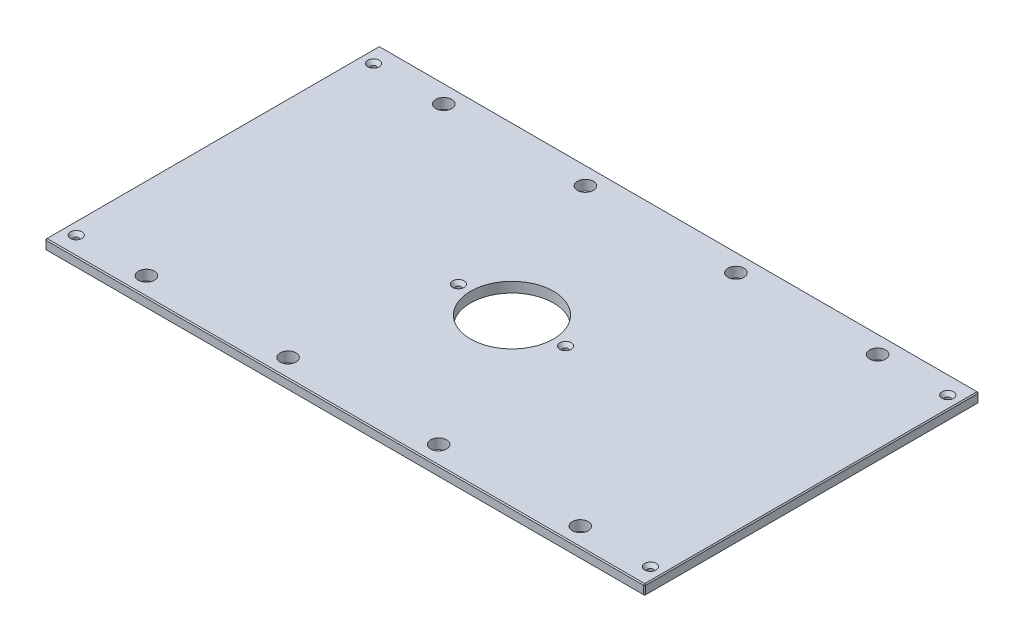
ISO-10303-21;
HEADER;
FILE_DESCRIPTION(('STEP AP214'),'2;1');
FILE_NAME('part.step','',(''),(''),'','','');
FILE_SCHEMA(('AUTOMOTIVE_DESIGN { 1 0 10303 214 1 1 1 1 }'));
ENDSEC;
DATA;
#1=APPLICATION_CONTEXT('core data for automotive mechanical design processes');
#2=APPLICATION_PROTOCOL_DEFINITION('international standard','automotive_design',2000,#1);
#3=PRODUCT_CONTEXT('',#1,'mechanical');
#4=PRODUCT('Part','Part','',(#3));
#5=PRODUCT_RELATED_PRODUCT_CATEGORY('part','',(#4));
#6=PRODUCT_DEFINITION_FORMATION('','',#4);
#7=PRODUCT_DEFINITION_CONTEXT('part definition',#1,'design');
#8=PRODUCT_DEFINITION('design','',#6,#7);
#9=PRODUCT_DEFINITION_SHAPE('','',#8);
#10=(LENGTH_UNIT() NAMED_UNIT(*) SI_UNIT(.MILLI.,.METRE.));
#11=(NAMED_UNIT(*) PLANE_ANGLE_UNIT() SI_UNIT($,.RADIAN.));
#12=(NAMED_UNIT(*) SI_UNIT($,.STERADIAN.) SOLID_ANGLE_UNIT());
#13=UNCERTAINTY_MEASURE_WITH_UNIT(LENGTH_MEASURE(1.E-05),#10,'distance_accuracy_value','');
#14=(GEOMETRIC_REPRESENTATION_CONTEXT(3) GLOBAL_UNCERTAINTY_ASSIGNED_CONTEXT((#13)) GLOBAL_UNIT_ASSIGNED_CONTEXT((#10,
#11,#12)) REPRESENTATION_CONTEXT('',''));
#15=CARTESIAN_POINT('',(0.,0.,0.));
#16=DIRECTION('',(0.,0.,1.));
#17=DIRECTION('',(1.,0.,0.));
#18=AXIS2_PLACEMENT_3D('',#15,#16,#17);
#19=CARTESIAN_POINT('',(-373.0625,12.7,-207.9625));
#20=DIRECTION('',(1.,0.,0.));
#21=DIRECTION('',(0.,0.,-1.));
#22=AXIS2_PLACEMENT_3D('',#19,#20,#21);
#23=PLANE('',#22);
#24=DIRECTION('',(0.,0.,-1.));
#25=VECTOR('',#24,1.);
#26=CARTESIAN_POINT('',(-373.0625,11.4299999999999,-207.9625));
#27=LINE('',#26,#25);
#28=CARTESIAN_POINT('',(-373.0625,11.4299999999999,206.6925));
#29=VERTEX_POINT('',#28);
#30=CARTESIAN_POINT('',(-373.0625,11.4299999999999,-206.6925));
#31=VERTEX_POINT('',#30);
#32=EDGE_CURVE('E135',#29,#31,#27,.T.);
#33=ORIENTED_EDGE('',*,*,#32,.T.);
#34=DIRECTION('',(0.,-1.,0.));
#35=VECTOR('',#34,1.);
#36=CARTESIAN_POINT('',(-373.0625,12.7,-206.6925));
#37=LINE('',#36,#35);
#38=CARTESIAN_POINT('',(-373.0625,1.2700000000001,-206.6925));
#39=VERTEX_POINT('',#38);
#40=EDGE_CURVE('E131',#31,#39,#37,.T.);
#41=ORIENTED_EDGE('',*,*,#40,.T.);
#42=DIRECTION('',(0.,0.,1.));
#43=VECTOR('',#42,1.);
#44=CARTESIAN_POINT('',(-373.0625,1.2700000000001,-207.9625));
#45=LINE('',#44,#43);
#46=CARTESIAN_POINT('',(-373.0625,1.2700000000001,206.6925));
#47=VERTEX_POINT('',#46);
#48=EDGE_CURVE('E126',#39,#47,#45,.T.);
#49=ORIENTED_EDGE('',*,*,#48,.T.);
#50=DIRECTION('',(0.,1.,0.));
#51=VECTOR('',#50,1.);
#52=CARTESIAN_POINT('',(-373.0625,12.7,206.6925));
#53=LINE('',#52,#51);
#54=EDGE_CURVE('E128',#47,#29,#53,.T.);
#55=ORIENTED_EDGE('',*,*,#54,.T.);
#56=EDGE_LOOP('',(#33,#41,#49,#55));
#57=FACE_BOUND('',#56,.T.);
#58=ADVANCED_FACE('F35',(#57),#23,.F.);
#59=CARTESIAN_POINT('',(-373.0625,12.7,207.9625));
#60=DIRECTION('',(0.,0.,-1.));
#61=DIRECTION('',(-1.,0.,0.));
#62=AXIS2_PLACEMENT_3D('',#59,#60,#61);
#63=PLANE('',#62);
#64=DIRECTION('',(1.,0.,0.));
#65=VECTOR('',#64,1.);
#66=CARTESIAN_POINT('',(-373.0625,1.2700000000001,207.9625));
#67=LINE('',#66,#65);
#68=CARTESIAN_POINT('',(-371.7925,1.2700000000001,207.9625));
#69=VERTEX_POINT('',#68);
#70=CARTESIAN_POINT('',(371.7925,1.2700000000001,207.9625));
#71=VERTEX_POINT('',#70);
#72=EDGE_CURVE('E58',#69,#71,#67,.T.);
#73=ORIENTED_EDGE('',*,*,#72,.T.);
#74=DIRECTION('',(0.,1.,0.));
#75=VECTOR('',#74,1.);
#76=CARTESIAN_POINT('',(371.7925,12.7,207.9625));
#77=LINE('',#76,#75);
#78=CARTESIAN_POINT('',(371.7925,11.4299999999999,207.9625));
#79=VERTEX_POINT('',#78);
#80=EDGE_CURVE('E11',#71,#79,#77,.T.);
#81=ORIENTED_EDGE('',*,*,#80,.T.);
#82=DIRECTION('',(-1.,0.,0.));
#83=VECTOR('',#82,1.);
#84=CARTESIAN_POINT('',(-373.0625,11.4299999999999,207.9625));
#85=LINE('',#84,#83);
#86=CARTESIAN_POINT('',(-371.7925,11.4299999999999,207.9625));
#87=VERTEX_POINT('',#86);
#88=EDGE_CURVE('E44',#79,#87,#85,.T.);
#89=ORIENTED_EDGE('',*,*,#88,.T.);
#90=DIRECTION('',(0.,-1.,0.));
#91=VECTOR('',#90,1.);
#92=CARTESIAN_POINT('',(-371.7925,12.7,207.9625));
#93=LINE('',#92,#91);
#94=EDGE_CURVE('E303',#87,#69,#93,.T.);
#95=ORIENTED_EDGE('',*,*,#94,.T.);
#96=EDGE_LOOP('',(#73,#81,#89,#95));
#97=FACE_BOUND('',#96,.T.);
#98=ADVANCED_FACE('F372',(#97),#63,.F.);
#99=CARTESIAN_POINT('',(373.0625,12.7,-207.9625));
#100=DIRECTION('',(-1.,0.,0.));
#101=DIRECTION('',(0.,0.,1.));
#102=AXIS2_PLACEMENT_3D('',#99,#100,#101);
#103=PLANE('',#102);
#104=DIRECTION('',(0.,0.,-1.));
#105=VECTOR('',#104,1.);
#106=CARTESIAN_POINT('',(373.0625,1.2700000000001,-207.9625));
#107=LINE('',#106,#105);
#108=CARTESIAN_POINT('',(373.0625,1.2700000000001,206.6925));
#109=VERTEX_POINT('',#108);
#110=CARTESIAN_POINT('',(373.0625,1.2700000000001,-206.6925));
#111=VERTEX_POINT('',#110);
#112=EDGE_CURVE('E298',#109,#111,#107,.T.);
#113=ORIENTED_EDGE('',*,*,#112,.T.);
#114=DIRECTION('',(0.,1.,0.));
#115=VECTOR('',#114,1.);
#116=CARTESIAN_POINT('',(373.0625,12.7,-206.6925));
#117=LINE('',#116,#115);
#118=CARTESIAN_POINT('',(373.0625,11.4299999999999,-206.6925));
#119=VERTEX_POINT('',#118);
#120=EDGE_CURVE('E300',#111,#119,#117,.T.);
#121=ORIENTED_EDGE('',*,*,#120,.T.);
#122=DIRECTION('',(0.,0.,1.));
#123=VECTOR('',#122,1.);
#124=CARTESIAN_POINT('',(373.0625,11.4299999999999,207.9625));
#125=LINE('',#124,#123);
#126=CARTESIAN_POINT('',(373.0625,11.4299999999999,206.6925));
#127=VERTEX_POINT('',#126);
#128=EDGE_CURVE('E296',#119,#127,#125,.T.);
#129=ORIENTED_EDGE('',*,*,#128,.T.);
#130=DIRECTION('',(0.,-1.,0.));
#131=VECTOR('',#130,1.);
#132=CARTESIAN_POINT('',(373.0625,12.7,206.6925));
#133=LINE('',#132,#131);
#134=EDGE_CURVE('E294',#127,#109,#133,.T.);
#135=ORIENTED_EDGE('',*,*,#134,.T.);
#136=EDGE_LOOP('',(#113,#121,#129,#135));
#137=FACE_BOUND('',#136,.T.);
#138=ADVANCED_FACE('F359',(#137),#103,.F.);
#139=CARTESIAN_POINT('',(-373.0625,12.7,-207.9625));
#140=DIRECTION('',(0.,0.,1.));
#141=DIRECTION('',(1.,0.,0.));
#142=AXIS2_PLACEMENT_3D('',#139,#140,#141);
#143=PLANE('',#142);
#144=DIRECTION('',(-1.,0.,0.));
#145=VECTOR('',#144,1.);
#146=CARTESIAN_POINT('',(-373.0625,1.2700000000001,-207.9625));
#147=LINE('',#146,#145);
#148=CARTESIAN_POINT('',(371.7925,1.2700000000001,-207.9625));
#149=VERTEX_POINT('',#148);
#150=CARTESIAN_POINT('',(-371.7925,1.2700000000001,-207.9625));
#151=VERTEX_POINT('',#150);
#152=EDGE_CURVE('E270',#149,#151,#147,.T.);
#153=ORIENTED_EDGE('',*,*,#152,.T.);
#154=DIRECTION('',(0.,1.,0.));
#155=VECTOR('',#154,1.);
#156=CARTESIAN_POINT('',(-371.7925,12.7,-207.9625));
#157=LINE('',#156,#155);
#158=CARTESIAN_POINT('',(-371.7925,11.4299999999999,-207.9625));
#159=VERTEX_POINT('',#158);
#160=EDGE_CURVE('E274',#151,#159,#157,.T.);
#161=ORIENTED_EDGE('',*,*,#160,.T.);
#162=DIRECTION('',(1.,0.,0.));
#163=VECTOR('',#162,1.);
#164=CARTESIAN_POINT('',(373.0625,11.4299999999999,-207.9625));
#165=LINE('',#164,#163);
#166=CARTESIAN_POINT('',(371.7925,11.4299999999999,-207.9625));
#167=VERTEX_POINT('',#166);
#168=EDGE_CURVE('E272',#159,#167,#165,.T.);
#169=ORIENTED_EDGE('',*,*,#168,.T.);
#170=DIRECTION('',(0.,-1.,0.));
#171=VECTOR('',#170,1.);
#172=CARTESIAN_POINT('',(371.7925,12.7,-207.9625));
#173=LINE('',#172,#171);
#174=EDGE_CURVE('E268',#167,#149,#173,.T.);
#175=ORIENTED_EDGE('',*,*,#174,.T.);
#176=EDGE_LOOP('',(#153,#161,#169,#175));
#177=FACE_BOUND('',#176,.T.);
#178=ADVANCED_FACE('F333',(#177),#143,.F.);
#179=CARTESIAN_POINT('',(0.,12.7,0.));
#180=DIRECTION('',(0.,1.,0.));
#181=DIRECTION('',(0.,0.,1.));
#182=AXIS2_PLACEMENT_3D('',#179,#180,#181);
#183=PLANE('',#182);
#184=CARTESIAN_POINT('',(357.1875,12.7,-184.94248));
#185=DIRECTION('',(0.,1.,0.));
#186=DIRECTION('',(0.,0.,1.));
#187=AXIS2_PLACEMENT_3D('',#184,#185,#186);
#188=CIRCLE('',#187,7.13740000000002);
#189=CARTESIAN_POINT('',(357.1875,12.7,-177.80508));
#190=VERTEX_POINT('',#189);
#191=EDGE_CURVE('E816',#190,#190,#188,.T.);
#192=ORIENTED_EDGE('',*,*,#191,.F.);
#193=EDGE_LOOP('',(#192));
#194=FACE_BOUND('',#193,.T.);
#195=CARTESIAN_POINT('',(357.1875,12.7,184.94248));
#196=DIRECTION('',(0.,1.,0.));
#197=DIRECTION('',(0.,0.,1.));
#198=AXIS2_PLACEMENT_3D('',#195,#196,#197);
#199=CIRCLE('',#198,7.13740000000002);
#200=CARTESIAN_POINT('',(357.1875,12.7,192.07988));
#201=VERTEX_POINT('',#200);
#202=EDGE_CURVE('E820',#201,#201,#199,.T.);
#203=ORIENTED_EDGE('',*,*,#202,.F.);
#204=EDGE_LOOP('',(#203));
#205=FACE_BOUND('',#204,.T.);
#206=CARTESIAN_POINT('',(-357.1875,12.7,184.94248));
#207=DIRECTION('',(0.,1.,0.));
#208=DIRECTION('',(0.,0.,1.));
#209=AXIS2_PLACEMENT_3D('',#206,#207,#208);
#210=CIRCLE('',#209,7.13740000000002);
#211=CARTESIAN_POINT('',(-357.1875,12.7,192.07988));
#212=VERTEX_POINT('',#211);
#213=EDGE_CURVE('E824',#212,#212,#210,.T.);
#214=ORIENTED_EDGE('',*,*,#213,.F.);
#215=EDGE_LOOP('',(#214));
#216=FACE_BOUND('',#215,.T.);
#217=CARTESIAN_POINT('',(-66.675,12.7,0.));
#218=DIRECTION('',(0.,1.,0.));
#219=DIRECTION('',(0.,0.,1.));
#220=AXIS2_PLACEMENT_3D('',#217,#218,#219);
#221=CIRCLE('',#220,7.1374);
#222=CARTESIAN_POINT('',(-66.675,12.7,7.1374));
#223=VERTEX_POINT('',#222);
#224=EDGE_CURVE('E828',#223,#223,#221,.T.);
#225=ORIENTED_EDGE('',*,*,#224,.F.);
#226=EDGE_LOOP('',(#225));
#227=FACE_BOUND('',#226,.T.);
#228=CARTESIAN_POINT('',(66.675,12.7,0.));
#229=DIRECTION('',(0.,1.,0.));
#230=DIRECTION('',(0.,0.,1.));
#231=AXIS2_PLACEMENT_3D('',#228,#229,#230);
#232=CIRCLE('',#231,7.1374);
#233=CARTESIAN_POINT('',(66.675,12.7,7.1374));
#234=VERTEX_POINT('',#233);
#235=EDGE_CURVE('E832',#234,#234,#232,.T.);
#236=ORIENTED_EDGE('',*,*,#235,.F.);
#237=EDGE_LOOP('',(#236));
#238=FACE_BOUND('',#237,.T.);
#239=CARTESIAN_POINT('',(-357.1875,12.7,-184.94248));
#240=DIRECTION('',(0.,1.,0.));
#241=DIRECTION('',(0.,0.,1.));
#242=AXIS2_PLACEMENT_3D('',#239,#240,#241);
#243=CIRCLE('',#242,7.13740000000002);
#244=CARTESIAN_POINT('',(-357.1875,12.7,-177.80508));
#245=VERTEX_POINT('',#244);
#246=EDGE_CURVE('E835',#245,#245,#243,.T.);
#247=ORIENTED_EDGE('',*,*,#246,.F.);
#248=EDGE_LOOP('',(#247));
#249=FACE_BOUND('',#248,.T.);
#250=DIRECTION('',(0.,0.,-1.));
#251=VECTOR('',#250,1.);
#252=CARTESIAN_POINT('',(371.7925,12.7,-207.9625));
#253=LINE('',#252,#251);
#254=CARTESIAN_POINT('',(371.7925,12.7,206.6925));
#255=VERTEX_POINT('',#254);
#256=CARTESIAN_POINT('',(371.7925,12.7,-206.6925));
#257=VERTEX_POINT('',#256);
#258=EDGE_CURVE('E281',#255,#257,#253,.T.);
#259=ORIENTED_EDGE('',*,*,#258,.T.);
#260=DIRECTION('',(-1.,0.,0.));
#261=VECTOR('',#260,1.);
#262=CARTESIAN_POINT('',(-373.0625,12.7,-206.6925));
#263=LINE('',#262,#261);
#264=CARTESIAN_POINT('',(-371.7925,12.7,-206.6925));
#265=VERTEX_POINT('',#264);
#266=EDGE_CURVE('E283',#257,#265,#263,.T.);
#267=ORIENTED_EDGE('',*,*,#266,.T.);
#268=DIRECTION('',(0.,0.,1.));
#269=VECTOR('',#268,1.);
#270=CARTESIAN_POINT('',(-371.7925,12.7,207.9625));
#271=LINE('',#270,#269);
#272=CARTESIAN_POINT('',(-371.7925,12.7,206.6925));
#273=VERTEX_POINT('',#272);
#274=EDGE_CURVE('E279',#265,#273,#271,.T.);
#275=ORIENTED_EDGE('',*,*,#274,.T.);
#276=DIRECTION('',(1.,0.,0.));
#277=VECTOR('',#276,1.);
#278=CARTESIAN_POINT('',(373.0625,12.7,206.6925));
#279=LINE('',#278,#277);
#280=EDGE_CURVE('E277',#273,#255,#279,.T.);
#281=ORIENTED_EDGE('',*,*,#280,.T.);
#282=EDGE_LOOP('',(#259,#267,#275,#281));
#283=FACE_BOUND('',#282,.T.);
#284=CARTESIAN_POINT('',(269.875,12.7,-184.94248));
#285=DIRECTION('',(0.,1.,0.));
#286=DIRECTION('',(0.,0.,1.));
#287=AXIS2_PLACEMENT_3D('',#284,#285,#286);
#288=CIRCLE('',#287,9.92187500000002);
#289=CARTESIAN_POINT('',(269.875,12.7,-175.020605));
#290=VERTEX_POINT('',#289);
#291=EDGE_CURVE('E204',#290,#290,#288,.T.);
#292=ORIENTED_EDGE('',*,*,#291,.F.);
#293=EDGE_LOOP('',(#292));
#294=FACE_BOUND('',#293,.T.);
#295=CARTESIAN_POINT('',(-269.875,12.7,-184.94248));
#296=DIRECTION('',(0.,1.,0.));
#297=DIRECTION('',(0.,0.,1.));
#298=AXIS2_PLACEMENT_3D('',#295,#296,#297);
#299=CIRCLE('',#298,9.92187500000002);
#300=CARTESIAN_POINT('',(-269.875,12.7,-175.020605));
#301=VERTEX_POINT('',#300);
#302=EDGE_CURVE('E214',#301,#301,#299,.T.);
#303=ORIENTED_EDGE('',*,*,#302,.F.);
#304=EDGE_LOOP('',(#303));
#305=FACE_BOUND('',#304,.T.);
#306=CARTESIAN_POINT('',(269.875,12.7,184.94248));
#307=DIRECTION('',(0.,1.,0.));
#308=DIRECTION('',(0.,0.,1.));
#309=AXIS2_PLACEMENT_3D('',#306,#307,#308);
#310=CIRCLE('',#309,9.92187500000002);
#311=CARTESIAN_POINT('',(269.875,12.7,194.864355));
#312=VERTEX_POINT('',#311);
#313=EDGE_CURVE('E225',#312,#312,#310,.T.);
#314=ORIENTED_EDGE('',*,*,#313,.F.);
#315=EDGE_LOOP('',(#314));
#316=FACE_BOUND('',#315,.T.);
#317=CARTESIAN_POINT('',(-269.875,12.7,184.94248));
#318=DIRECTION('',(0.,1.,0.));
#319=DIRECTION('',(0.,0.,1.));
#320=AXIS2_PLACEMENT_3D('',#317,#318,#319);
#321=CIRCLE('',#320,9.92187500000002);
#322=CARTESIAN_POINT('',(-269.875,12.7,194.864355));
#323=VERTEX_POINT('',#322);
#324=EDGE_CURVE('E231',#323,#323,#321,.T.);
#325=ORIENTED_EDGE('',*,*,#324,.F.);
#326=EDGE_LOOP('',(#325));
#327=FACE_BOUND('',#326,.T.);
#328=CARTESIAN_POINT('',(-93.6625,12.7,-184.94248));
#329=DIRECTION('',(0.,1.,0.));
#330=DIRECTION('',(0.,0.,1.));
#331=AXIS2_PLACEMENT_3D('',#328,#329,#330);
#332=CIRCLE('',#331,9.921875);
#333=CARTESIAN_POINT('',(-93.6625,12.7,-175.020605));
#334=VERTEX_POINT('',#333);
#335=EDGE_CURVE('E237',#334,#334,#332,.T.);
#336=ORIENTED_EDGE('',*,*,#335,.F.);
#337=EDGE_LOOP('',(#336));
#338=FACE_BOUND('',#337,.T.);
#339=CARTESIAN_POINT('',(93.6625,12.7,-184.94248));
#340=DIRECTION('',(0.,1.,0.));
#341=DIRECTION('',(0.,0.,1.));
#342=AXIS2_PLACEMENT_3D('',#339,#340,#341);
#343=CIRCLE('',#342,9.921875);
#344=CARTESIAN_POINT('',(93.6625,12.7,-175.020605));
#345=VERTEX_POINT('',#344);
#346=EDGE_CURVE('E243',#345,#345,#343,.T.);
#347=ORIENTED_EDGE('',*,*,#346,.F.);
#348=EDGE_LOOP('',(#347));
#349=FACE_BOUND('',#348,.T.);
#350=CARTESIAN_POINT('',(93.6625,12.7,184.94248));
#351=DIRECTION('',(0.,1.,0.));
#352=DIRECTION('',(0.,0.,1.));
#353=AXIS2_PLACEMENT_3D('',#350,#351,#352);
#354=CIRCLE('',#353,9.921875);
#355=CARTESIAN_POINT('',(93.6625,12.7,194.864355));
#356=VERTEX_POINT('',#355);
#357=EDGE_CURVE('E249',#356,#356,#354,.T.);
#358=ORIENTED_EDGE('',*,*,#357,.F.);
#359=EDGE_LOOP('',(#358));
#360=FACE_BOUND('',#359,.T.);
#361=CARTESIAN_POINT('',(-93.6625,12.7,184.94248));
#362=DIRECTION('',(0.,1.,0.));
#363=DIRECTION('',(0.,0.,1.));
#364=AXIS2_PLACEMENT_3D('',#361,#362,#363);
#365=CIRCLE('',#364,9.921875);
#366=CARTESIAN_POINT('',(-93.6625,12.7,194.864355));
#367=VERTEX_POINT('',#366);
#368=EDGE_CURVE('E255',#367,#367,#365,.T.);
#369=ORIENTED_EDGE('',*,*,#368,.F.);
#370=EDGE_LOOP('',(#369));
#371=FACE_BOUND('',#370,.T.);
#372=CARTESIAN_POINT('',(0.,12.7,0.));
#373=DIRECTION('',(0.,1.,0.));
#374=DIRECTION('',(0.,0.,1.));
#375=AXIS2_PLACEMENT_3D('',#372,#373,#374);
#376=CIRCLE('',#375,51.562);
#377=CARTESIAN_POINT('',(0.,12.7,51.562));
#378=VERTEX_POINT('',#377);
#379=EDGE_CURVE('E261',#378,#378,#376,.T.);
#380=ORIENTED_EDGE('',*,*,#379,.F.);
#381=EDGE_LOOP('',(#380));
#382=FACE_BOUND('',#381,.T.);
#383=ADVANCED_FACE('F381',(#194,#205,#216,#227,#238,#249,#283,#294,#305,#316,#327,#338,#349,
#360,#371,#382),#183,.T.);
#384=CARTESIAN_POINT('',(0.,0.,0.));
#385=DIRECTION('',(0.,1.,0.));
#386=DIRECTION('',(0.,0.,1.));
#387=AXIS2_PLACEMENT_3D('',#384,#385,#386);
#388=PLANE('',#387);
#389=CARTESIAN_POINT('',(357.1875,0.,-184.94248));
#390=DIRECTION('',(0.,1.,0.));
#391=DIRECTION('',(0.,0.,1.));
#392=AXIS2_PLACEMENT_3D('',#389,#390,#391);
#393=CIRCLE('',#392,3.3782);
#394=CARTESIAN_POINT('',(357.1875,0.,-181.56428));
#395=VERTEX_POINT('',#394);
#396=EDGE_CURVE('E869',#395,#395,#393,.T.);
#397=ORIENTED_EDGE('',*,*,#396,.T.);
#398=EDGE_LOOP('',(#397));
#399=FACE_BOUND('',#398,.T.);
#400=CARTESIAN_POINT('',(357.1875,0.,184.94248));
#401=DIRECTION('',(0.,1.,0.));
#402=DIRECTION('',(0.,0.,1.));
#403=AXIS2_PLACEMENT_3D('',#400,#401,#402);
#404=CIRCLE('',#403,3.3782);
#405=CARTESIAN_POINT('',(357.1875,0.,188.32068));
#406=VERTEX_POINT('',#405);
#407=EDGE_CURVE('E862',#406,#406,#404,.T.);
#408=ORIENTED_EDGE('',*,*,#407,.T.);
#409=EDGE_LOOP('',(#408));
#410=FACE_BOUND('',#409,.T.);
#411=CARTESIAN_POINT('',(-357.1875,0.,184.94248));
#412=DIRECTION('',(0.,1.,0.));
#413=DIRECTION('',(0.,0.,1.));
#414=AXIS2_PLACEMENT_3D('',#411,#412,#413);
#415=CIRCLE('',#414,3.3782);
#416=CARTESIAN_POINT('',(-357.1875,0.,188.32068));
#417=VERTEX_POINT('',#416);
#418=EDGE_CURVE('E855',#417,#417,#415,.T.);
#419=ORIENTED_EDGE('',*,*,#418,.T.);
#420=EDGE_LOOP('',(#419));
#421=FACE_BOUND('',#420,.T.);
#422=CARTESIAN_POINT('',(-66.675,0.,0.));
#423=DIRECTION('',(0.,1.,0.));
#424=DIRECTION('',(0.,0.,1.));
#425=AXIS2_PLACEMENT_3D('',#422,#423,#424);
#426=CIRCLE('',#425,3.3782);
#427=CARTESIAN_POINT('',(-66.675,0.,3.3782));
#428=VERTEX_POINT('',#427);
#429=EDGE_CURVE('E848',#428,#428,#426,.T.);
#430=ORIENTED_EDGE('',*,*,#429,.T.);
#431=EDGE_LOOP('',(#430));
#432=FACE_BOUND('',#431,.T.);
#433=CARTESIAN_POINT('',(66.675,0.,0.));
#434=DIRECTION('',(0.,1.,0.));
#435=DIRECTION('',(0.,0.,1.));
#436=AXIS2_PLACEMENT_3D('',#433,#434,#435);
#437=CIRCLE('',#436,3.3782);
#438=CARTESIAN_POINT('',(66.675,0.,3.3782));
#439=VERTEX_POINT('',#438);
#440=EDGE_CURVE('E838',#439,#439,#437,.T.);
#441=ORIENTED_EDGE('',*,*,#440,.T.);
#442=EDGE_LOOP('',(#441));
#443=FACE_BOUND('',#442,.T.);
#444=CARTESIAN_POINT('',(-357.1875,0.,-184.94248));
#445=DIRECTION('',(0.,1.,0.));
#446=DIRECTION('',(0.,0.,1.));
#447=AXIS2_PLACEMENT_3D('',#444,#445,#446);
#448=CIRCLE('',#447,3.3782);
#449=CARTESIAN_POINT('',(-357.1875,0.,-181.56428));
#450=VERTEX_POINT('',#449);
#451=EDGE_CURVE('E217',#450,#450,#448,.T.);
#452=ORIENTED_EDGE('',*,*,#451,.T.);
#453=EDGE_LOOP('',(#452));
#454=FACE_BOUND('',#453,.T.);
#455=DIRECTION('',(0.,0.,-1.));
#456=VECTOR('',#455,1.);
#457=CARTESIAN_POINT('',(-371.7925,0.,0.));
#458=LINE('',#457,#456);
#459=CARTESIAN_POINT('',(-371.7925,0.,206.6925));
#460=VERTEX_POINT('',#459);
#461=CARTESIAN_POINT('',(-371.7925,0.,-206.6925));
#462=VERTEX_POINT('',#461);
#463=EDGE_CURVE('E158',#460,#462,#458,.T.);
#464=ORIENTED_EDGE('',*,*,#463,.T.);
#465=DIRECTION('',(1.,0.,0.));
#466=VECTOR('',#465,1.);
#467=CARTESIAN_POINT('',(0.,0.,-206.6925));
#468=LINE('',#467,#466);
#469=CARTESIAN_POINT('',(371.7925,0.,-206.6925));
#470=VERTEX_POINT('',#469);
#471=EDGE_CURVE('E291',#462,#470,#468,.T.);
#472=ORIENTED_EDGE('',*,*,#471,.T.);
#473=DIRECTION('',(0.,0.,1.));
#474=VECTOR('',#473,1.);
#475=CARTESIAN_POINT('',(371.7925,0.,0.));
#476=LINE('',#475,#474);
#477=CARTESIAN_POINT('',(371.7925,0.,206.6925));
#478=VERTEX_POINT('',#477);
#479=EDGE_CURVE('E289',#470,#478,#476,.T.);
#480=ORIENTED_EDGE('',*,*,#479,.T.);
#481=DIRECTION('',(-1.,0.,0.));
#482=VECTOR('',#481,1.);
#483=CARTESIAN_POINT('',(0.,0.,206.6925));
#484=LINE('',#483,#482);
#485=EDGE_CURVE('E286',#478,#460,#484,.T.);
#486=ORIENTED_EDGE('',*,*,#485,.T.);
#487=EDGE_LOOP('',(#464,#472,#480,#486));
#488=FACE_BOUND('',#487,.T.);
#489=CARTESIAN_POINT('',(269.875,0.,-184.94248));
#490=DIRECTION('',(0.,1.,0.));
#491=DIRECTION('',(0.,0.,1.));
#492=AXIS2_PLACEMENT_3D('',#489,#490,#491);
#493=CIRCLE('',#492,9.92187500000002);
#494=CARTESIAN_POINT('',(269.875,0.,-175.020605));
#495=VERTEX_POINT('',#494);
#496=EDGE_CURVE('E209',#495,#495,#493,.T.);
#497=ORIENTED_EDGE('',*,*,#496,.T.);
#498=EDGE_LOOP('',(#497));
#499=FACE_BOUND('',#498,.T.);
#500=CARTESIAN_POINT('',(-269.875,0.,-184.94248));
#501=DIRECTION('',(0.,1.,0.));
#502=DIRECTION('',(0.,0.,1.));
#503=AXIS2_PLACEMENT_3D('',#500,#501,#502);
#504=CIRCLE('',#503,9.92187500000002);
#505=CARTESIAN_POINT('',(-269.875,0.,-175.020605));
#506=VERTEX_POINT('',#505);
#507=EDGE_CURVE('E222',#506,#506,#504,.T.);
#508=ORIENTED_EDGE('',*,*,#507,.T.);
#509=EDGE_LOOP('',(#508));
#510=FACE_BOUND('',#509,.T.);
#511=CARTESIAN_POINT('',(269.875,0.,184.94248));
#512=DIRECTION('',(0.,1.,0.));
#513=DIRECTION('',(0.,0.,1.));
#514=AXIS2_PLACEMENT_3D('',#511,#512,#513);
#515=CIRCLE('',#514,9.92187500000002);
#516=CARTESIAN_POINT('',(269.875,0.,194.864355));
#517=VERTEX_POINT('',#516);
#518=EDGE_CURVE('E228',#517,#517,#515,.T.);
#519=ORIENTED_EDGE('',*,*,#518,.T.);
#520=EDGE_LOOP('',(#519));
#521=FACE_BOUND('',#520,.T.);
#522=CARTESIAN_POINT('',(-269.875,0.,184.94248));
#523=DIRECTION('',(0.,1.,0.));
#524=DIRECTION('',(0.,0.,1.));
#525=AXIS2_PLACEMENT_3D('',#522,#523,#524);
#526=CIRCLE('',#525,9.92187500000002);
#527=CARTESIAN_POINT('',(-269.875,0.,194.864355));
#528=VERTEX_POINT('',#527);
#529=EDGE_CURVE('E234',#528,#528,#526,.T.);
#530=ORIENTED_EDGE('',*,*,#529,.T.);
#531=EDGE_LOOP('',(#530));
#532=FACE_BOUND('',#531,.T.);
#533=CARTESIAN_POINT('',(-93.6625,0.,-184.94248));
#534=DIRECTION('',(0.,1.,0.));
#535=DIRECTION('',(0.,0.,1.));
#536=AXIS2_PLACEMENT_3D('',#533,#534,#535);
#537=CIRCLE('',#536,9.921875);
#538=CARTESIAN_POINT('',(-93.6625,0.,-175.020605));
#539=VERTEX_POINT('',#538);
#540=EDGE_CURVE('E240',#539,#539,#537,.T.);
#541=ORIENTED_EDGE('',*,*,#540,.T.);
#542=EDGE_LOOP('',(#541));
#543=FACE_BOUND('',#542,.T.);
#544=CARTESIAN_POINT('',(93.6625,0.,-184.94248));
#545=DIRECTION('',(0.,1.,0.));
#546=DIRECTION('',(0.,0.,1.));
#547=AXIS2_PLACEMENT_3D('',#544,#545,#546);
#548=CIRCLE('',#547,9.921875);
#549=CARTESIAN_POINT('',(93.6625,0.,-175.020605));
#550=VERTEX_POINT('',#549);
#551=EDGE_CURVE('E246',#550,#550,#548,.T.);
#552=ORIENTED_EDGE('',*,*,#551,.T.);
#553=EDGE_LOOP('',(#552));
#554=FACE_BOUND('',#553,.T.);
#555=CARTESIAN_POINT('',(93.6625,0.,184.94248));
#556=DIRECTION('',(0.,1.,0.));
#557=DIRECTION('',(0.,0.,1.));
#558=AXIS2_PLACEMENT_3D('',#555,#556,#557);
#559=CIRCLE('',#558,9.921875);
#560=CARTESIAN_POINT('',(93.6625,0.,194.864355));
#561=VERTEX_POINT('',#560);
#562=EDGE_CURVE('E252',#561,#561,#559,.T.);
#563=ORIENTED_EDGE('',*,*,#562,.T.);
#564=EDGE_LOOP('',(#563));
#565=FACE_BOUND('',#564,.T.);
#566=CARTESIAN_POINT('',(-93.6625,0.,184.94248));
#567=DIRECTION('',(0.,1.,0.));
#568=DIRECTION('',(0.,0.,1.));
#569=AXIS2_PLACEMENT_3D('',#566,#567,#568);
#570=CIRCLE('',#569,9.921875);
#571=CARTESIAN_POINT('',(-93.6625,0.,194.864355));
#572=VERTEX_POINT('',#571);
#573=EDGE_CURVE('E258',#572,#572,#570,.T.);
#574=ORIENTED_EDGE('',*,*,#573,.T.);
#575=EDGE_LOOP('',(#574));
#576=FACE_BOUND('',#575,.T.);
#577=CARTESIAN_POINT('',(0.,0.,0.));
#578=DIRECTION('',(0.,1.,0.));
#579=DIRECTION('',(0.,0.,1.));
#580=AXIS2_PLACEMENT_3D('',#577,#578,#579);
#581=CIRCLE('',#580,51.562);
#582=CARTESIAN_POINT('',(0.,0.,51.562));
#583=VERTEX_POINT('',#582);
#584=EDGE_CURVE('E147',#583,#583,#581,.T.);
#585=ORIENTED_EDGE('',*,*,#584,.T.);
#586=EDGE_LOOP('',(#585));
#587=FACE_BOUND('',#586,.T.);
#588=ADVANCED_FACE('F346',(#399,#410,#421,#432,#443,#454,#488,#499,#510,#521,#532,#543,#554,
#565,#576,#587),#388,.F.);
#589=CARTESIAN_POINT('',(0.,0.,0.));
#590=DIRECTION('',(0.,1.,0.));
#591=DIRECTION('',(0.,0.,1.));
#592=AXIS2_PLACEMENT_3D('',#589,#590,#591);
#593=CYLINDRICAL_SURFACE('',#592,51.562);
#594=ORIENTED_EDGE('',*,*,#584,.F.);
#595=EDGE_LOOP('',(#594));
#596=FACE_BOUND('',#595,.T.);
#597=ORIENTED_EDGE('',*,*,#379,.T.);
#598=EDGE_LOOP('',(#597));
#599=FACE_BOUND('',#598,.T.);
#600=ADVANCED_FACE('F751',(#596,#599),#593,.F.);
#601=CARTESIAN_POINT('',(-93.6625,12.7,184.94248));
#602=DIRECTION('',(0.,1.,0.));
#603=DIRECTION('',(0.,0.,1.));
#604=AXIS2_PLACEMENT_3D('',#601,#602,#603);
#605=CYLINDRICAL_SURFACE('',#604,9.921875);
#606=ORIENTED_EDGE('',*,*,#573,.F.);
#607=EDGE_LOOP('',(#606));
#608=FACE_BOUND('',#607,.T.);
#609=ORIENTED_EDGE('',*,*,#368,.T.);
#610=EDGE_LOOP('',(#609));
#611=FACE_BOUND('',#610,.T.);
#612=ADVANCED_FACE('F742',(#608,#611),#605,.F.);
#613=CARTESIAN_POINT('',(93.6625,12.7,184.94248));
#614=DIRECTION('',(0.,1.,0.));
#615=DIRECTION('',(0.,0.,1.));
#616=AXIS2_PLACEMENT_3D('',#613,#614,#615);
#617=CYLINDRICAL_SURFACE('',#616,9.921875);
#618=ORIENTED_EDGE('',*,*,#562,.F.);
#619=EDGE_LOOP('',(#618));
#620=FACE_BOUND('',#619,.T.);
#621=ORIENTED_EDGE('',*,*,#357,.T.);
#622=EDGE_LOOP('',(#621));
#623=FACE_BOUND('',#622,.T.);
#624=ADVANCED_FACE('F733',(#620,#623),#617,.F.);
#625=CARTESIAN_POINT('',(93.6625,12.7,-184.94248));
#626=DIRECTION('',(0.,1.,0.));
#627=DIRECTION('',(0.,0.,1.));
#628=AXIS2_PLACEMENT_3D('',#625,#626,#627);
#629=CYLINDRICAL_SURFACE('',#628,9.921875);
#630=ORIENTED_EDGE('',*,*,#551,.F.);
#631=EDGE_LOOP('',(#630));
#632=FACE_BOUND('',#631,.T.);
#633=ORIENTED_EDGE('',*,*,#346,.T.);
#634=EDGE_LOOP('',(#633));
#635=FACE_BOUND('',#634,.T.);
#636=ADVANCED_FACE('F724',(#632,#635),#629,.F.);
#637=CARTESIAN_POINT('',(-93.6625,12.7,-184.94248));
#638=DIRECTION('',(0.,1.,0.));
#639=DIRECTION('',(0.,0.,1.));
#640=AXIS2_PLACEMENT_3D('',#637,#638,#639);
#641=CYLINDRICAL_SURFACE('',#640,9.921875);
#642=ORIENTED_EDGE('',*,*,#540,.F.);
#643=EDGE_LOOP('',(#642));
#644=FACE_BOUND('',#643,.T.);
#645=ORIENTED_EDGE('',*,*,#335,.T.);
#646=EDGE_LOOP('',(#645));
#647=FACE_BOUND('',#646,.T.);
#648=ADVANCED_FACE('F715',(#644,#647),#641,.F.);
#649=CARTESIAN_POINT('',(-269.875,12.7,184.94248));
#650=DIRECTION('',(0.,1.,0.));
#651=DIRECTION('',(0.,0.,1.));
#652=AXIS2_PLACEMENT_3D('',#649,#650,#651);
#653=CYLINDRICAL_SURFACE('',#652,9.92187500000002);
#654=ORIENTED_EDGE('',*,*,#529,.F.);
#655=EDGE_LOOP('',(#654));
#656=FACE_BOUND('',#655,.T.);
#657=ORIENTED_EDGE('',*,*,#324,.T.);
#658=EDGE_LOOP('',(#657));
#659=FACE_BOUND('',#658,.T.);
#660=ADVANCED_FACE('F706',(#656,#659),#653,.F.);
#661=CARTESIAN_POINT('',(269.875,12.7,184.94248));
#662=DIRECTION('',(0.,1.,0.));
#663=DIRECTION('',(0.,0.,1.));
#664=AXIS2_PLACEMENT_3D('',#661,#662,#663);
#665=CYLINDRICAL_SURFACE('',#664,9.92187500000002);
#666=ORIENTED_EDGE('',*,*,#518,.F.);
#667=EDGE_LOOP('',(#666));
#668=FACE_BOUND('',#667,.T.);
#669=ORIENTED_EDGE('',*,*,#313,.T.);
#670=EDGE_LOOP('',(#669));
#671=FACE_BOUND('',#670,.T.);
#672=ADVANCED_FACE('F697',(#668,#671),#665,.F.);
#673=CARTESIAN_POINT('',(-269.875,12.7,-184.94248));
#674=DIRECTION('',(0.,1.,0.));
#675=DIRECTION('',(0.,0.,1.));
#676=AXIS2_PLACEMENT_3D('',#673,#674,#675);
#677=CYLINDRICAL_SURFACE('',#676,9.92187500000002);
#678=ORIENTED_EDGE('',*,*,#507,.F.);
#679=EDGE_LOOP('',(#678));
#680=FACE_BOUND('',#679,.T.);
#681=ORIENTED_EDGE('',*,*,#302,.T.);
#682=EDGE_LOOP('',(#681));
#683=FACE_BOUND('',#682,.T.);
#684=ADVANCED_FACE('F687',(#680,#683),#677,.F.);
#685=CARTESIAN_POINT('',(269.875,12.7,-184.94248));
#686=DIRECTION('',(0.,1.,0.));
#687=DIRECTION('',(0.,0.,1.));
#688=AXIS2_PLACEMENT_3D('',#685,#686,#687);
#689=CYLINDRICAL_SURFACE('',#688,9.92187500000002);
#690=ORIENTED_EDGE('',*,*,#496,.F.);
#691=EDGE_LOOP('',(#690));
#692=FACE_BOUND('',#691,.T.);
#693=ORIENTED_EDGE('',*,*,#291,.T.);
#694=EDGE_LOOP('',(#693));
#695=FACE_BOUND('',#694,.T.);
#696=ADVANCED_FACE('F390',(#692,#695),#689,.F.);
#697=CARTESIAN_POINT('',(373.0625,12.7,206.6925));
#698=DIRECTION('',(-0.707106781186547,0.,-0.707106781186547));
#699=DIRECTION('',(0.,-1.,0.));
#700=AXIS2_PLACEMENT_3D('',#697,#698,#699);
#701=PLANE('',#700);
#702=DIRECTION('',(-0.707106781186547,0.,0.707106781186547));
#703=VECTOR('',#702,1.);
#704=CARTESIAN_POINT('',(373.0625,11.4299999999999,206.6925));
#705=LINE('',#704,#703);
#706=EDGE_CURVE('E39',#79,#127,#705,.F.);
#707=ORIENTED_EDGE('',*,*,#706,.F.);
#708=ORIENTED_EDGE('',*,*,#80,.F.);
#709=DIRECTION('',(0.707106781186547,0.,-0.707106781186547));
#710=VECTOR('',#709,1.);
#711=CARTESIAN_POINT('',(372.4275,1.2700000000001,207.3275));
#712=LINE('',#711,#710);
#713=EDGE_CURVE('E197',#109,#71,#712,.F.);
#714=ORIENTED_EDGE('',*,*,#713,.F.);
#715=ORIENTED_EDGE('',*,*,#134,.F.);
#716=EDGE_LOOP('',(#707,#708,#714,#715));
#717=FACE_BOUND('',#716,.T.);
#718=ADVANCED_FACE('F37',(#717),#701,.F.);
#719=CARTESIAN_POINT('',(373.0625,11.4299999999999,206.6925));
#720=DIRECTION('',(0.577350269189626,0.577350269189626,0.577350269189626));
#721=DIRECTION('',(0.707106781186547,0.,-0.707106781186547));
#722=AXIS2_PLACEMENT_3D('',#719,#720,#721);
#723=PLANE('',#722);
#724=DIRECTION('',(0.,-0.707106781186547,0.707106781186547));
#725=VECTOR('',#724,1.);
#726=CARTESIAN_POINT('',(371.7925,12.0649999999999,207.3275));
#727=LINE('',#726,#725);
#728=EDGE_CURVE('E193',#79,#255,#727,.F.);
#729=ORIENTED_EDGE('',*,*,#728,.F.);
#730=ORIENTED_EDGE('',*,*,#706,.T.);
#731=DIRECTION('',(-0.707106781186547,0.707106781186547,0.));
#732=VECTOR('',#731,1.);
#733=CARTESIAN_POINT('',(373.0625,11.4299999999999,206.6925));
#734=LINE('',#733,#732);
#735=EDGE_CURVE('E195',#255,#127,#734,.F.);
#736=ORIENTED_EDGE('',*,*,#735,.F.);
#737=EDGE_LOOP('',(#729,#730,#736));
#738=FACE_BOUND('',#737,.T.);
#739=ADVANCED_FACE('F383',(#738),#723,.T.);
#740=CARTESIAN_POINT('',(371.7925,0.,206.6925));
#741=DIRECTION('',(0.577350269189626,-0.577350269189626,0.577350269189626));
#742=DIRECTION('',(0.707106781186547,0.,-0.707106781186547));
#743=AXIS2_PLACEMENT_3D('',#740,#741,#742);
#744=PLANE('',#743);
#745=DIRECTION('',(-0.707106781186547,-0.707106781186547,0.));
#746=VECTOR('',#745,1.);
#747=CARTESIAN_POINT('',(371.7925,0.,206.6925));
#748=LINE('',#747,#746);
#749=EDGE_CURVE('E187',#109,#478,#748,.T.);
#750=ORIENTED_EDGE('',*,*,#749,.F.);
#751=ORIENTED_EDGE('',*,*,#713,.T.);
#752=DIRECTION('',(0.,0.707106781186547,0.707106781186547));
#753=VECTOR('',#752,1.);
#754=CARTESIAN_POINT('',(371.7925,0.,206.6925));
#755=LINE('',#754,#753);
#756=EDGE_CURVE('E190',#478,#71,#755,.T.);
#757=ORIENTED_EDGE('',*,*,#756,.F.);
#758=EDGE_LOOP('',(#750,#751,#757));
#759=FACE_BOUND('',#758,.T.);
#760=ADVANCED_FACE('F352',(#759),#744,.T.);
#761=CARTESIAN_POINT('',(371.7925,12.7,0.));
#762=DIRECTION('',(0.707106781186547,0.707106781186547,0.));
#763=DIRECTION('',(0.,0.,1.));
#764=AXIS2_PLACEMENT_3D('',#761,#762,#763);
#765=PLANE('',#764);
#766=ORIENTED_EDGE('',*,*,#735,.T.);
#767=ORIENTED_EDGE('',*,*,#128,.F.);
#768=DIRECTION('',(0.707106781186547,-0.707106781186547,0.));
#769=VECTOR('',#768,1.);
#770=CARTESIAN_POINT('',(372.4275,12.0649999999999,-206.6925));
#771=LINE('',#770,#769);
#772=EDGE_CURVE('E182',#257,#119,#771,.T.);
#773=ORIENTED_EDGE('',*,*,#772,.F.);
#774=ORIENTED_EDGE('',*,*,#258,.F.);
#775=EDGE_LOOP('',(#766,#767,#773,#774));
#776=FACE_BOUND('',#775,.T.);
#777=ADVANCED_FACE('F369',(#776),#765,.T.);
#778=CARTESIAN_POINT('',(0.,12.7,206.6925));
#779=DIRECTION('',(0.,0.707106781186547,0.707106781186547));
#780=DIRECTION('',(-1.,0.,0.));
#781=AXIS2_PLACEMENT_3D('',#778,#779,#780);
#782=PLANE('',#781);
#783=ORIENTED_EDGE('',*,*,#728,.T.);
#784=ORIENTED_EDGE('',*,*,#280,.F.);
#785=DIRECTION('',(0.,0.707106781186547,-0.707106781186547));
#786=VECTOR('',#785,1.);
#787=CARTESIAN_POINT('',(-371.7925,12.7,206.6925));
#788=LINE('',#787,#786);
#789=EDGE_CURVE('E179',#87,#273,#788,.T.);
#790=ORIENTED_EDGE('',*,*,#789,.F.);
#791=ORIENTED_EDGE('',*,*,#88,.F.);
#792=EDGE_LOOP('',(#783,#784,#790,#791));
#793=FACE_BOUND('',#792,.T.);
#794=ADVANCED_FACE('F374',(#793),#782,.T.);
#795=CARTESIAN_POINT('',(-371.7925,12.7,207.9625));
#796=DIRECTION('',(0.707106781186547,0.,-0.707106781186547));
#797=DIRECTION('',(0.,-1.,0.));
#798=AXIS2_PLACEMENT_3D('',#795,#796,#797);
#799=PLANE('',#798);
#800=DIRECTION('',(0.707106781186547,0.,0.707106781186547));
#801=VECTOR('',#800,1.);
#802=CARTESIAN_POINT('',(-373.0625,1.2700000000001,206.6925));
#803=LINE('',#802,#801);
#804=EDGE_CURVE('E142',#69,#47,#803,.F.);
#805=ORIENTED_EDGE('',*,*,#804,.F.);
#806=ORIENTED_EDGE('',*,*,#94,.F.);
#807=DIRECTION('',(-0.707106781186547,0.,-0.707106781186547));
#808=VECTOR('',#807,1.);
#809=CARTESIAN_POINT('',(-372.4275,11.4299999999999,207.3275));
#810=LINE('',#809,#808);
#811=EDGE_CURVE('E145',#29,#87,#810,.F.);
#812=ORIENTED_EDGE('',*,*,#811,.F.);
#813=ORIENTED_EDGE('',*,*,#54,.F.);
#814=EDGE_LOOP('',(#805,#806,#812,#813));
#815=FACE_BOUND('',#814,.T.);
#816=ADVANCED_FACE('F140',(#815),#799,.F.);
#817=CARTESIAN_POINT('',(-373.0625,1.2700000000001,207.9625));
#818=DIRECTION('',(0.,0.707106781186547,-0.707106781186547));
#819=DIRECTION('',(1.,0.,0.));
#820=AXIS2_PLACEMENT_3D('',#817,#818,#819);
#821=PLANE('',#820);
#822=ORIENTED_EDGE('',*,*,#756,.T.);
#823=ORIENTED_EDGE('',*,*,#72,.F.);
#824=DIRECTION('',(0.,-0.707106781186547,-0.707106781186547));
#825=VECTOR('',#824,1.);
#826=CARTESIAN_POINT('',(-371.7925,0.635000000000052,207.3275));
#827=LINE('',#826,#825);
#828=EDGE_CURVE('E155',#460,#69,#827,.F.);
#829=ORIENTED_EDGE('',*,*,#828,.F.);
#830=ORIENTED_EDGE('',*,*,#485,.F.);
#831=EDGE_LOOP('',(#822,#823,#829,#830));
#832=FACE_BOUND('',#831,.T.);
#833=ADVANCED_FACE('F351',(#832),#821,.F.);
#834=CARTESIAN_POINT('',(373.0625,1.2700000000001,-207.9625));
#835=DIRECTION('',(-0.707106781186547,0.707106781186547,0.));
#836=DIRECTION('',(0.,0.,-1.));
#837=AXIS2_PLACEMENT_3D('',#834,#835,#836);
#838=PLANE('',#837);
#839=ORIENTED_EDGE('',*,*,#749,.T.);
#840=ORIENTED_EDGE('',*,*,#479,.F.);
#841=DIRECTION('',(0.707106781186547,0.707106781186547,0.));
#842=VECTOR('',#841,1.);
#843=CARTESIAN_POINT('',(371.7925,0.,-206.6925));
#844=LINE('',#843,#842);
#845=EDGE_CURVE('E174',#111,#470,#844,.F.);
#846=ORIENTED_EDGE('',*,*,#845,.F.);
#847=ORIENTED_EDGE('',*,*,#112,.F.);
#848=EDGE_LOOP('',(#839,#840,#846,#847));
#849=FACE_BOUND('',#848,.T.);
#850=ADVANCED_FACE('F356',(#849),#838,.F.);
#851=CARTESIAN_POINT('',(371.7925,12.7,-207.9625));
#852=DIRECTION('',(-0.707106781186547,0.,0.707106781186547));
#853=DIRECTION('',(0.,-1.,0.));
#854=AXIS2_PLACEMENT_3D('',#851,#852,#853);
#855=PLANE('',#854);
#856=DIRECTION('',(0.707106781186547,0.,0.707106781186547));
#857=VECTOR('',#856,1.);
#858=CARTESIAN_POINT('',(371.7925,11.4299999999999,-207.9625));
#859=LINE('',#858,#857);
#860=EDGE_CURVE('E184',#119,#167,#859,.F.);
#861=ORIENTED_EDGE('',*,*,#860,.F.);
#862=ORIENTED_EDGE('',*,*,#120,.F.);
#863=DIRECTION('',(-0.707106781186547,0.,-0.707106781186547));
#864=VECTOR('',#863,1.);
#865=CARTESIAN_POINT('',(372.4275,1.2700000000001,-207.3275));
#866=LINE('',#865,#864);
#867=EDGE_CURVE('E171',#149,#111,#866,.F.);
#868=ORIENTED_EDGE('',*,*,#867,.F.);
#869=ORIENTED_EDGE('',*,*,#174,.F.);
#870=EDGE_LOOP('',(#861,#862,#868,#869));
#871=FACE_BOUND('',#870,.T.);
#872=ADVANCED_FACE('F364',(#871),#855,.F.);
#873=CARTESIAN_POINT('',(371.7925,11.4299999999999,-207.9625));
#874=DIRECTION('',(0.577350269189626,0.577350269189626,-0.577350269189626));
#875=DIRECTION('',(-0.707106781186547,0.,-0.707106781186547));
#876=AXIS2_PLACEMENT_3D('',#873,#874,#875);
#877=PLANE('',#876);
#878=ORIENTED_EDGE('',*,*,#772,.T.);
#879=ORIENTED_EDGE('',*,*,#860,.T.);
#880=DIRECTION('',(0.,0.707106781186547,0.707106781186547));
#881=VECTOR('',#880,1.);
#882=CARTESIAN_POINT('',(371.7925,11.4299999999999,-207.9625));
#883=LINE('',#882,#881);
#884=EDGE_CURVE('E163',#257,#167,#883,.F.);
#885=ORIENTED_EDGE('',*,*,#884,.F.);
#886=EDGE_LOOP('',(#878,#879,#885));
#887=FACE_BOUND('',#886,.T.);
#888=ADVANCED_FACE('F422',(#887),#877,.T.);
#889=CARTESIAN_POINT('',(-371.7925,12.7,206.6925));
#890=DIRECTION('',(-0.577350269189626,0.577350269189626,0.577350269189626));
#891=DIRECTION('',(0.707106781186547,0.,0.707106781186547));
#892=AXIS2_PLACEMENT_3D('',#889,#890,#891);
#893=PLANE('',#892);
#894=ORIENTED_EDGE('',*,*,#811,.T.);
#895=ORIENTED_EDGE('',*,*,#789,.T.);
#896=DIRECTION('',(-0.707106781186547,-0.707106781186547,0.));
#897=VECTOR('',#896,1.);
#898=CARTESIAN_POINT('',(-371.7925,12.7,206.6925));
#899=LINE('',#898,#897);
#900=EDGE_CURVE('E159',#29,#273,#899,.F.);
#901=ORIENTED_EDGE('',*,*,#900,.F.);
#902=EDGE_LOOP('',(#894,#895,#901));
#903=FACE_BOUND('',#902,.T.);
#904=ADVANCED_FACE('F376',(#903),#893,.T.);
#905=CARTESIAN_POINT('',(-373.0625,1.2700000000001,206.6925));
#906=DIRECTION('',(-0.577350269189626,-0.577350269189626,0.577350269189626));
#907=DIRECTION('',(0.707106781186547,0.,0.707106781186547));
#908=AXIS2_PLACEMENT_3D('',#905,#906,#907);
#909=PLANE('',#908);
#910=ORIENTED_EDGE('',*,*,#828,.T.);
#911=ORIENTED_EDGE('',*,*,#804,.T.);
#912=DIRECTION('',(-0.707106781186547,0.707106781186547,0.));
#913=VECTOR('',#912,1.);
#914=CARTESIAN_POINT('',(-373.0625,1.2700000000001,206.6925));
#915=LINE('',#914,#913);
#916=EDGE_CURVE('E152',#460,#47,#915,.T.);
#917=ORIENTED_EDGE('',*,*,#916,.F.);
#918=EDGE_LOOP('',(#910,#911,#917));
#919=FACE_BOUND('',#918,.T.);
#920=ADVANCED_FACE('F151',(#919),#909,.T.);
#921=CARTESIAN_POINT('',(371.7925,0.,-206.6925));
#922=DIRECTION('',(0.577350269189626,-0.577350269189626,-0.577350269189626));
#923=DIRECTION('',(-0.707106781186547,0.,-0.707106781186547));
#924=AXIS2_PLACEMENT_3D('',#921,#922,#923);
#925=PLANE('',#924);
#926=ORIENTED_EDGE('',*,*,#867,.T.);
#927=ORIENTED_EDGE('',*,*,#845,.T.);
#928=DIRECTION('',(0.,-0.707106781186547,0.707106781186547));
#929=VECTOR('',#928,1.);
#930=CARTESIAN_POINT('',(371.7925,0.,-206.6925));
#931=LINE('',#930,#929);
#932=EDGE_CURVE('E160',#149,#470,#931,.T.);
#933=ORIENTED_EDGE('',*,*,#932,.F.);
#934=EDGE_LOOP('',(#926,#927,#933));
#935=FACE_BOUND('',#934,.T.);
#936=ADVANCED_FACE('F414',(#935),#925,.T.);
#937=CARTESIAN_POINT('',(0.,12.7,-206.6925));
#938=DIRECTION('',(0.,0.707106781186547,-0.707106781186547));
#939=DIRECTION('',(1.,0.,0.));
#940=AXIS2_PLACEMENT_3D('',#937,#938,#939);
#941=PLANE('',#940);
#942=ORIENTED_EDGE('',*,*,#884,.T.);
#943=ORIENTED_EDGE('',*,*,#168,.F.);
#944=DIRECTION('',(0.,-0.707106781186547,-0.707106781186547));
#945=VECTOR('',#944,1.);
#946=CARTESIAN_POINT('',(-371.7925,11.4299999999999,-207.9625));
#947=LINE('',#946,#945);
#948=EDGE_CURVE('E165',#265,#159,#947,.T.);
#949=ORIENTED_EDGE('',*,*,#948,.F.);
#950=ORIENTED_EDGE('',*,*,#266,.F.);
#951=EDGE_LOOP('',(#942,#943,#949,#950));
#952=FACE_BOUND('',#951,.T.);
#953=ADVANCED_FACE('F328',(#952),#941,.T.);
#954=CARTESIAN_POINT('',(-371.7925,12.7,0.));
#955=DIRECTION('',(-0.707106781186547,0.707106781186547,0.));
#956=DIRECTION('',(0.,0.,-1.));
#957=AXIS2_PLACEMENT_3D('',#954,#955,#956);
#958=PLANE('',#957);
#959=ORIENTED_EDGE('',*,*,#900,.T.);
#960=ORIENTED_EDGE('',*,*,#274,.F.);
#961=DIRECTION('',(0.707106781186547,0.707106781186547,0.));
#962=VECTOR('',#961,1.);
#963=CARTESIAN_POINT('',(-372.4275,12.0649999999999,-206.6925));
#964=LINE('',#963,#962);
#965=EDGE_CURVE('E317',#31,#265,#964,.T.);
#966=ORIENTED_EDGE('',*,*,#965,.F.);
#967=ORIENTED_EDGE('',*,*,#32,.F.);
#968=EDGE_LOOP('',(#959,#960,#966,#967));
#969=FACE_BOUND('',#968,.T.);
#970=ADVANCED_FACE('F379',(#969),#958,.T.);
#971=CARTESIAN_POINT('',(-373.0625,1.2700000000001,-207.9625));
#972=DIRECTION('',(0.707106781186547,0.707106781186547,0.));
#973=DIRECTION('',(0.,0.,1.));
#974=AXIS2_PLACEMENT_3D('',#971,#972,#973);
#975=PLANE('',#974);
#976=ORIENTED_EDGE('',*,*,#916,.T.);
#977=ORIENTED_EDGE('',*,*,#48,.F.);
#978=DIRECTION('',(0.707106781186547,-0.707106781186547,0.));
#979=VECTOR('',#978,1.);
#980=CARTESIAN_POINT('',(-373.0625,1.2700000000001,-206.6925));
#981=LINE('',#980,#979);
#982=EDGE_CURVE('E314',#462,#39,#981,.F.);
#983=ORIENTED_EDGE('',*,*,#982,.F.);
#984=ORIENTED_EDGE('',*,*,#463,.F.);
#985=EDGE_LOOP('',(#976,#977,#983,#984));
#986=FACE_BOUND('',#985,.T.);
#987=ADVANCED_FACE('F157',(#986),#975,.F.);
#988=CARTESIAN_POINT('',(-373.0625,1.2700000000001,-207.9625));
#989=DIRECTION('',(0.,0.707106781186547,0.707106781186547));
#990=DIRECTION('',(-1.,0.,0.));
#991=AXIS2_PLACEMENT_3D('',#988,#989,#990);
#992=PLANE('',#991);
#993=ORIENTED_EDGE('',*,*,#932,.T.);
#994=ORIENTED_EDGE('',*,*,#471,.F.);
#995=DIRECTION('',(0.,0.707106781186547,-0.707106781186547));
#996=VECTOR('',#995,1.);
#997=CARTESIAN_POINT('',(-371.7925,0.635000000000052,-207.3275));
#998=LINE('',#997,#996);
#999=EDGE_CURVE('E311',#151,#462,#998,.F.);
#1000=ORIENTED_EDGE('',*,*,#999,.F.);
#1001=ORIENTED_EDGE('',*,*,#152,.F.);
#1002=EDGE_LOOP('',(#993,#994,#1000,#1001));
#1003=FACE_BOUND('',#1002,.T.);
#1004=ADVANCED_FACE('F343',(#1003),#992,.F.);
#1005=CARTESIAN_POINT('',(-371.7925,11.4299999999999,-207.9625));
#1006=DIRECTION('',(-0.577350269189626,0.577350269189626,-0.577350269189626));
#1007=DIRECTION('',(-0.707106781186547,0.,0.707106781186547));
#1008=AXIS2_PLACEMENT_3D('',#1005,#1006,#1007);
#1009=PLANE('',#1008);
#1010=ORIENTED_EDGE('',*,*,#965,.T.);
#1011=ORIENTED_EDGE('',*,*,#948,.T.);
#1012=DIRECTION('',(0.707106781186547,0.,-0.707106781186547));
#1013=VECTOR('',#1012,1.);
#1014=CARTESIAN_POINT('',(-371.7925,11.4299999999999,-207.9625));
#1015=LINE('',#1014,#1013);
#1016=EDGE_CURVE('E309',#31,#159,#1015,.T.);
#1017=ORIENTED_EDGE('',*,*,#1016,.F.);
#1018=EDGE_LOOP('',(#1010,#1011,#1017));
#1019=FACE_BOUND('',#1018,.T.);
#1020=ADVANCED_FACE('F323',(#1019),#1009,.T.);
#1021=CARTESIAN_POINT('',(-373.0625,1.2700000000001,-206.6925));
#1022=DIRECTION('',(-0.577350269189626,-0.577350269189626,-0.577350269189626));
#1023=DIRECTION('',(-0.707106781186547,0.,0.707106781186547));
#1024=AXIS2_PLACEMENT_3D('',#1021,#1022,#1023);
#1025=PLANE('',#1024);
#1026=ORIENTED_EDGE('',*,*,#999,.T.);
#1027=ORIENTED_EDGE('',*,*,#982,.T.);
#1028=DIRECTION('',(-0.707106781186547,0.,0.707106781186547));
#1029=VECTOR('',#1028,1.);
#1030=CARTESIAN_POINT('',(-373.0625,1.2700000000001,-206.6925));
#1031=LINE('',#1030,#1029);
#1032=EDGE_CURVE('E307',#151,#39,#1031,.T.);
#1033=ORIENTED_EDGE('',*,*,#1032,.F.);
#1034=EDGE_LOOP('',(#1026,#1027,#1033));
#1035=FACE_BOUND('',#1034,.T.);
#1036=ADVANCED_FACE('F340',(#1035),#1025,.T.);
#1037=CARTESIAN_POINT('',(-373.0625,12.7,-206.6925));
#1038=DIRECTION('',(0.707106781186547,0.,0.707106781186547));
#1039=DIRECTION('',(0.,-1.,0.));
#1040=AXIS2_PLACEMENT_3D('',#1037,#1038,#1039);
#1041=PLANE('',#1040);
#1042=ORIENTED_EDGE('',*,*,#1016,.T.);
#1043=ORIENTED_EDGE('',*,*,#160,.F.);
#1044=ORIENTED_EDGE('',*,*,#1032,.T.);
#1045=ORIENTED_EDGE('',*,*,#40,.F.);
#1046=EDGE_LOOP('',(#1042,#1043,#1044,#1045));
#1047=FACE_BOUND('',#1046,.T.);
#1048=ADVANCED_FACE('F338',(#1047),#1041,.F.);
#1049=CARTESIAN_POINT('',(-357.1875,12.7,-184.94248));
#1050=DIRECTION('',(0.,1.,0.));
#1051=DIRECTION('',(0.,0.,1.));
#1052=AXIS2_PLACEMENT_3D('',#1049,#1050,#1051);
#1053=CYLINDRICAL_SURFACE('',#1052,3.3782);
#1054=ORIENTED_EDGE('',*,*,#451,.F.);
#1055=EDGE_LOOP('',(#1054));
#1056=FACE_BOUND('',#1055,.T.);
#1057=CARTESIAN_POINT('',(-357.1875,8.37553508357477,-184.94248));
#1058=DIRECTION('',(0.,1.,0.));
#1059=DIRECTION('',(0.,0.,1.));
#1060=AXIS2_PLACEMENT_3D('',#1057,#1058,#1059);
#1061=CIRCLE('',#1060,3.3782);
#1062=CARTESIAN_POINT('',(-357.1875,8.37553508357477,-181.56428));
#1063=VERTEX_POINT('',#1062);
#1064=EDGE_CURVE('E837',#1063,#1063,#1061,.T.);
#1065=ORIENTED_EDGE('',*,*,#1064,.T.);
#1066=EDGE_LOOP('',(#1065));
#1067=FACE_BOUND('',#1066,.T.);
#1068=ADVANCED_FACE('F401',(#1056,#1067),#1053,.F.);
#1069=CARTESIAN_POINT('',(-357.1875,12.7,-184.94248));
#1070=DIRECTION('',(0.,1.,0.));
#1071=DIRECTION('',(0.,0.,1.));
#1072=AXIS2_PLACEMENT_3D('',#1069,#1070,#1071);
#1073=CONICAL_SURFACE('',#1072,7.13740000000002,0.715584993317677);
#1074=ORIENTED_EDGE('',*,*,#1064,.F.);
#1075=EDGE_LOOP('',(#1074));
#1076=FACE_BOUND('',#1075,.T.);
#1077=ORIENTED_EDGE('',*,*,#246,.T.);
#1078=EDGE_LOOP('',(#1077));
#1079=FACE_BOUND('',#1078,.T.);
#1080=ADVANCED_FACE('F511',(#1076,#1079),#1073,.F.);
#1081=CARTESIAN_POINT('',(66.675,12.7,0.));
#1082=DIRECTION('',(0.,1.,0.));
#1083=DIRECTION('',(0.,0.,1.));
#1084=AXIS2_PLACEMENT_3D('',#1081,#1082,#1083);
#1085=CYLINDRICAL_SURFACE('',#1084,3.3782);
#1086=ORIENTED_EDGE('',*,*,#440,.F.);
#1087=EDGE_LOOP('',(#1086));
#1088=FACE_BOUND('',#1087,.T.);
#1089=CARTESIAN_POINT('',(66.675,8.37553508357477,0.));
#1090=DIRECTION('',(0.,1.,0.));
#1091=DIRECTION('',(0.,0.,1.));
#1092=AXIS2_PLACEMENT_3D('',#1089,#1090,#1091);
#1093=CIRCLE('',#1092,3.3782);
#1094=CARTESIAN_POINT('',(66.675,8.37553508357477,3.3782));
#1095=VERTEX_POINT('',#1094);
#1096=EDGE_CURVE('E842',#1095,#1095,#1093,.T.);
#1097=ORIENTED_EDGE('',*,*,#1096,.T.);
#1098=EDGE_LOOP('',(#1097));
#1099=FACE_BOUND('',#1098,.T.);
#1100=ADVANCED_FACE('F520',(#1088,#1099),#1085,.F.);
#1101=CARTESIAN_POINT('',(66.675,12.7,0.));
#1102=DIRECTION('',(0.,1.,0.));
#1103=DIRECTION('',(0.,0.,1.));
#1104=AXIS2_PLACEMENT_3D('',#1101,#1102,#1103);
#1105=CONICAL_SURFACE('',#1104,7.1374,0.715584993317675);
#1106=ORIENTED_EDGE('',*,*,#1096,.F.);
#1107=EDGE_LOOP('',(#1106));
#1108=FACE_BOUND('',#1107,.T.);
#1109=ORIENTED_EDGE('',*,*,#235,.T.);
#1110=EDGE_LOOP('',(#1109));
#1111=FACE_BOUND('',#1110,.T.);
#1112=ADVANCED_FACE('F528',(#1108,#1111),#1105,.F.);
#1113=CARTESIAN_POINT('',(-66.675,12.7,0.));
#1114=DIRECTION('',(0.,1.,0.));
#1115=DIRECTION('',(0.,0.,1.));
#1116=AXIS2_PLACEMENT_3D('',#1113,#1114,#1115);
#1117=CYLINDRICAL_SURFACE('',#1116,3.3782);
#1118=ORIENTED_EDGE('',*,*,#429,.F.);
#1119=EDGE_LOOP('',(#1118));
#1120=FACE_BOUND('',#1119,.T.);
#1121=CARTESIAN_POINT('',(-66.675,8.37553508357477,0.));
#1122=DIRECTION('',(0.,1.,0.));
#1123=DIRECTION('',(0.,0.,1.));
#1124=AXIS2_PLACEMENT_3D('',#1121,#1122,#1123);
#1125=CIRCLE('',#1124,3.3782);
#1126=CARTESIAN_POINT('',(-66.675,8.37553508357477,3.3782));
#1127=VERTEX_POINT('',#1126);
#1128=EDGE_CURVE('E851',#1127,#1127,#1125,.T.);
#1129=ORIENTED_EDGE('',*,*,#1128,.T.);
#1130=EDGE_LOOP('',(#1129));
#1131=FACE_BOUND('',#1130,.T.);
#1132=ADVANCED_FACE('F536',(#1120,#1131),#1117,.F.);
#1133=CARTESIAN_POINT('',(-66.675,12.7,0.));
#1134=DIRECTION('',(0.,1.,0.));
#1135=DIRECTION('',(0.,0.,1.));
#1136=AXIS2_PLACEMENT_3D('',#1133,#1134,#1135);
#1137=CONICAL_SURFACE('',#1136,7.1374,0.715584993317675);
#1138=ORIENTED_EDGE('',*,*,#1128,.F.);
#1139=EDGE_LOOP('',(#1138));
#1140=FACE_BOUND('',#1139,.T.);
#1141=ORIENTED_EDGE('',*,*,#224,.T.);
#1142=EDGE_LOOP('',(#1141));
#1143=FACE_BOUND('',#1142,.T.);
#1144=ADVANCED_FACE('F544',(#1140,#1143),#1137,.F.);
#1145=CARTESIAN_POINT('',(-357.1875,12.7,184.94248));
#1146=DIRECTION('',(0.,1.,0.));
#1147=DIRECTION('',(0.,0.,1.));
#1148=AXIS2_PLACEMENT_3D('',#1145,#1146,#1147);
#1149=CYLINDRICAL_SURFACE('',#1148,3.3782);
#1150=ORIENTED_EDGE('',*,*,#418,.F.);
#1151=EDGE_LOOP('',(#1150));
#1152=FACE_BOUND('',#1151,.T.);
#1153=CARTESIAN_POINT('',(-357.1875,8.37553508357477,184.94248));
#1154=DIRECTION('',(0.,1.,0.));
#1155=DIRECTION('',(0.,0.,1.));
#1156=AXIS2_PLACEMENT_3D('',#1153,#1154,#1155);
#1157=CIRCLE('',#1156,3.3782);
#1158=CARTESIAN_POINT('',(-357.1875,8.37553508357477,188.32068));
#1159=VERTEX_POINT('',#1158);
#1160=EDGE_CURVE('E858',#1159,#1159,#1157,.T.);
#1161=ORIENTED_EDGE('',*,*,#1160,.T.);
#1162=EDGE_LOOP('',(#1161));
#1163=FACE_BOUND('',#1162,.T.);
#1164=ADVANCED_FACE('F552',(#1152,#1163),#1149,.F.);
#1165=CARTESIAN_POINT('',(-357.1875,12.7,184.94248));
#1166=DIRECTION('',(0.,1.,0.));
#1167=DIRECTION('',(0.,0.,1.));
#1168=AXIS2_PLACEMENT_3D('',#1165,#1166,#1167);
#1169=CONICAL_SURFACE('',#1168,7.13740000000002,0.715584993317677);
#1170=ORIENTED_EDGE('',*,*,#1160,.F.);
#1171=EDGE_LOOP('',(#1170));
#1172=FACE_BOUND('',#1171,.T.);
#1173=ORIENTED_EDGE('',*,*,#213,.T.);
#1174=EDGE_LOOP('',(#1173));
#1175=FACE_BOUND('',#1174,.T.);
#1176=ADVANCED_FACE('F560',(#1172,#1175),#1169,.F.);
#1177=CARTESIAN_POINT('',(357.1875,12.7,184.94248));
#1178=DIRECTION('',(0.,1.,0.));
#1179=DIRECTION('',(0.,0.,1.));
#1180=AXIS2_PLACEMENT_3D('',#1177,#1178,#1179);
#1181=CYLINDRICAL_SURFACE('',#1180,3.3782);
#1182=ORIENTED_EDGE('',*,*,#407,.F.);
#1183=EDGE_LOOP('',(#1182));
#1184=FACE_BOUND('',#1183,.T.);
#1185=CARTESIAN_POINT('',(357.1875,8.37553508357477,184.94248));
#1186=DIRECTION('',(0.,1.,0.));
#1187=DIRECTION('',(0.,0.,1.));
#1188=AXIS2_PLACEMENT_3D('',#1185,#1186,#1187);
#1189=CIRCLE('',#1188,3.3782);
#1190=CARTESIAN_POINT('',(357.1875,8.37553508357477,188.32068));
#1191=VERTEX_POINT('',#1190);
#1192=EDGE_CURVE('E865',#1191,#1191,#1189,.T.);
#1193=ORIENTED_EDGE('',*,*,#1192,.T.);
#1194=EDGE_LOOP('',(#1193));
#1195=FACE_BOUND('',#1194,.T.);
#1196=ADVANCED_FACE('F568',(#1184,#1195),#1181,.F.);
#1197=CARTESIAN_POINT('',(357.1875,12.7,184.94248));
#1198=DIRECTION('',(0.,1.,0.));
#1199=DIRECTION('',(0.,0.,1.));
#1200=AXIS2_PLACEMENT_3D('',#1197,#1198,#1199);
#1201=CONICAL_SURFACE('',#1200,7.13740000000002,0.715584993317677);
#1202=ORIENTED_EDGE('',*,*,#1192,.F.);
#1203=EDGE_LOOP('',(#1202));
#1204=FACE_BOUND('',#1203,.T.);
#1205=ORIENTED_EDGE('',*,*,#202,.T.);
#1206=EDGE_LOOP('',(#1205));
#1207=FACE_BOUND('',#1206,.T.);
#1208=ADVANCED_FACE('F576',(#1204,#1207),#1201,.F.);
#1209=CARTESIAN_POINT('',(357.1875,12.7,-184.94248));
#1210=DIRECTION('',(0.,1.,0.));
#1211=DIRECTION('',(0.,0.,1.));
#1212=AXIS2_PLACEMENT_3D('',#1209,#1210,#1211);
#1213=CYLINDRICAL_SURFACE('',#1212,3.3782);
#1214=ORIENTED_EDGE('',*,*,#396,.F.);
#1215=EDGE_LOOP('',(#1214));
#1216=FACE_BOUND('',#1215,.T.);
#1217=CARTESIAN_POINT('',(357.1875,8.37553508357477,-184.94248));
#1218=DIRECTION('',(0.,1.,0.));
#1219=DIRECTION('',(0.,0.,1.));
#1220=AXIS2_PLACEMENT_3D('',#1217,#1218,#1219);
#1221=CIRCLE('',#1220,3.3782);
#1222=CARTESIAN_POINT('',(357.1875,8.37553508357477,-181.56428));
#1223=VERTEX_POINT('',#1222);
#1224=EDGE_CURVE('E872',#1223,#1223,#1221,.T.);
#1225=ORIENTED_EDGE('',*,*,#1224,.T.);
#1226=EDGE_LOOP('',(#1225));
#1227=FACE_BOUND('',#1226,.T.);
#1228=ADVANCED_FACE('F584',(#1216,#1227),#1213,.F.);
#1229=CARTESIAN_POINT('',(357.1875,12.7,-184.94248));
#1230=DIRECTION('',(0.,1.,0.));
#1231=DIRECTION('',(0.,0.,1.));
#1232=AXIS2_PLACEMENT_3D('',#1229,#1230,#1231);
#1233=CONICAL_SURFACE('',#1232,7.13740000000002,0.715584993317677);
#1234=ORIENTED_EDGE('',*,*,#1224,.F.);
#1235=EDGE_LOOP('',(#1234));
#1236=FACE_BOUND('',#1235,.T.);
#1237=ORIENTED_EDGE('',*,*,#191,.T.);
#1238=EDGE_LOOP('',(#1237));
#1239=FACE_BOUND('',#1238,.T.);
#1240=ADVANCED_FACE('F592',(#1236,#1239),#1233,.F.);
#1241=CLOSED_SHELL('',(#58,#98,#138,#178,#383,#588,#600,#612,#624,#636,#648,#660,#672,#684,#696,
#718,#739,#760,#777,#794,#816,#833,#850,#872,#888,#904,#920,#936,#953,#970,#987,#1004,#1020,
#1036,#1048,#1068,#1080,#1100,#1112,#1132,#1144,#1164,#1176,#1196,#1208,#1228,#1240));
#1242=MANIFOLD_SOLID_BREP('B2',#1241);
#1243=ADVANCED_BREP_SHAPE_REPRESENTATION('',(#18,#1242),#14);
#1244=SHAPE_DEFINITION_REPRESENTATION(#9,#1243);
ENDSEC;
END-ISO-10303-21;
